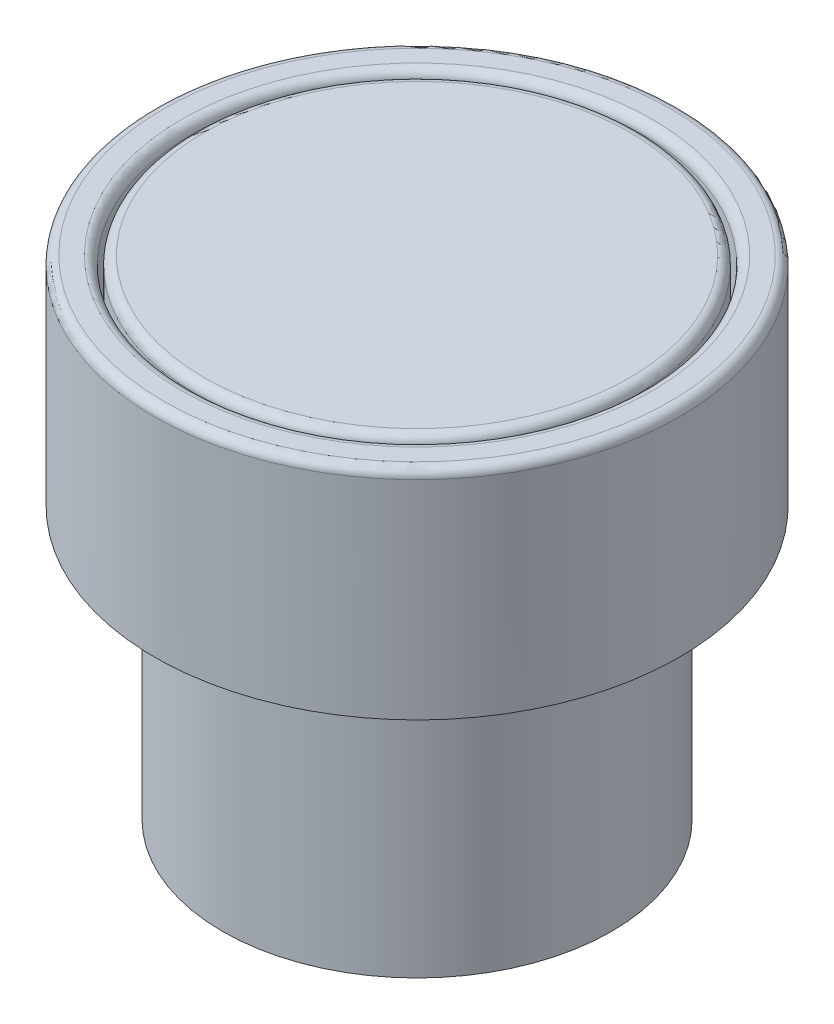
from build123d import *

# Parameters (mm, degrees)
SKETCH1_R           = 14.5
SKETCH1_R_2         = 12.5
BOSS_EXTRUDE1_DEPTH = 11
BOSS_EXTRUDE2_START = 1
SKETCH2_R           = 14.5
BOSS_EXTRUDE2_DEPTH = 1
SKETCH3_R           = 10.75
BOSS_EXTRUDE3_DEPTH = 15
SKETCH4_R           = 12.25
BOSS_EXTRUDE4_DEPTH = 11
FILLET1_R           = 0.5


with BuildPart() as part:
    # Sketch1 → Boss-Extrude1 (new body)
    with BuildSketch(Plane(origin=(0, 0, 0), x_dir=(1, 0, 0), z_dir=(0, 1, 0))):
        with Locations(Location((0, 0, 0), (0, 0, 270))):
            Circle(SKETCH1_R)
        with Locations(Location((0, 0, 0), (0, 0, 270))):
            Circle(SKETCH1_R_2, mode=Mode.SUBTRACT)
    extrude(amount=BOSS_EXTRUDE1_DEPTH)

    # Sketch2 → Boss-Extrude2 (add)
    with BuildSketch(Plane(origin=(0, 0, 0), x_dir=(-1, 0, 0), z_dir=(0, -1, 0)).offset(BOSS_EXTRUDE2_START)):
        with Locations(Location((0, 0, 0), (0, 0, 90))):
            Circle(SKETCH2_R)
    extrude(amount=-BOSS_EXTRUDE2_DEPTH)

    # Sketch3 → Boss-Extrude3 (add)
    with BuildSketch(Plane.XZ.offset(1)):
        with Locations(Location((0, 0, 0), (0, 0, 270))):
            Circle(SKETCH3_R)
    extrude(amount=BOSS_EXTRUDE3_DEPTH)

    # Sketch4 → Boss-Extrude4 (add)
    with BuildSketch(Plane(origin=(0, 0, 0), x_dir=(1, 0, 0), z_dir=(0, 1, 0))):
        with Locations(Location((0, 0, 0), (0, 0, 90))):
            Circle(SKETCH4_R)
    extrude(amount=BOSS_EXTRUDE4_DEPTH)

    # Fillet1
    fillet1_edges = [part.edges().sort_by_distance(p)[0] for p in [
        (0, 11, 12.25),
        (0, 11, -14.5),
        (0, 11, -12.5),
    ]]
    fillet(fillet1_edges, radius=FILLET1_R)


solid = part.part
